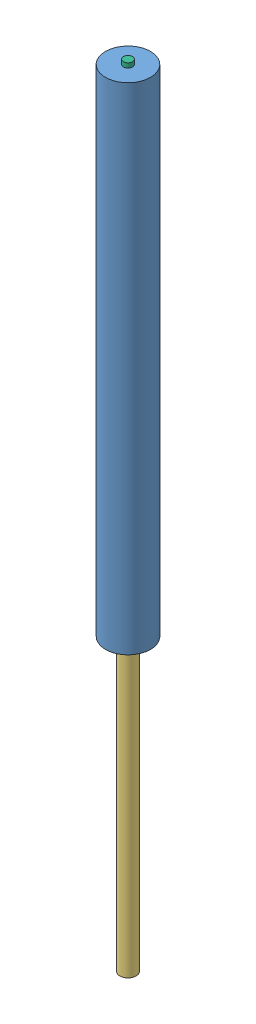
SolidWorks assembly Gas Lift System.SLDASM, configuration Default (file format 15000). Lengths in mm.
Overall size (54.46 876.94 54.46).
6 component instances, 6 part files, 12 mates.
Components (placement in the parent):
- Outer cylinder-1: Outer cylinder.SLDPRT [Default] at (213.86 144.9503 398.3266) size (50 550 50)
- Piston Guiding Cylinder-1: Piston Guiding Cylinder.SLDPRT [Default] at (154.1952 470.4424 393.582) x (0.96832 0 0.249713) z (-0.249713 0 0.96832) size (38 500 38)
- Piston-1: Piston.SLDPRT [Default] at (176.7643 58.5024 411.6908) x (-0.29793 0 -0.954588) z (0.954588 0 -0.29793) size (28 430 28)
- Retainer-1: Retainer.SLDPRT [Default] at (172.5932 -29.5576 398.3266) x (-0.872082 0 0.489359) z (-0.489359 0 -0.872082) size (40 15 40)
- Upper Retainer-1: Upper Retainer.SLDPRT [Default] at (167.5948 495.4424 398.1999) x (0.999679 0 0.02533) z (-0.02533 0 0.999679) size (40 40 40)
- Valve-1: Valve.SLDPRT [Default] at (172.5932 505.4424 398.3266) x (0.221821 0 -0.975087) z (0.975087 0 0.221821) size (14 50 14)
Mates (geometry in assembly coordinates):
- Concentric1: concentric aligned: cylinder of Piston-1 through (172.5932 58.5024 398.3266) axis (0 1 0) radius 9; cylinder of Outer cylinder-1 through (172.5932 445.4424 398.3266) axis (0 1 0) radius 10
- Concentric2: concentric aligned: cylinder of Outer cylinder-1 through (172.5932 445.4424 398.3266) axis (0 1 0) radius 25; cylinder of Piston Guiding Cylinder-1 through (172.5932 470.4424 398.3266) axis (0 1 0) radius 14
- Coincident1: coincident aligned: circle of Upper Retainer-1; cylinder of Valve-1 through (172.5932 505.4424 398.3266) axis (0 1 0) radius 5
- Concentric3: concentric aligned: cylinder of Piston Guiding Cylinder-1 through (172.5932 470.4424 398.3266) axis (0 1 0) radius 14; cylinder of Piston-1 through (172.5932 58.5024 398.3266) axis (0 1 0) radius 14
- Concentric4: concentric aligned: cylinder of Outer cylinder-1 through (172.5932 445.4424 398.3266) axis (0 1 0) radius 20; cylinder of Piston Guiding Cylinder-1 through (172.5932 470.4424 398.3266) axis (0 1 0) radius 19
- LimitDistance1: limit distance aligned: cone of Upper Retainer-1 through (172.5932 455.4424 398.3266) axis (0 1 0); cone of Valve-1 through (172.5932 457.4424 398.3266) axis (0 1 0)
- Concentric5: concentric aligned: cylinder of Outer cylinder-1 through (172.5932 445.4424 398.3266) axis (0 1 0) radius 20; cylinder of Upper Retainer-1 through (172.5932 498.401 398.3266) axis (0 1 0) radius 20
- Coincident3: coincident anti-aligned: plane of Piston Guiding Cylinder-1 through (159.0368 470.4424 394.8306) normal (0 1 0); plane of Upper Retainer-1 through (153.5993 470.4424 397.8453) normal (0 -1 0)
- Coincident4: coincident anti-aligned: plane of Outer cylinder-1 through (167.5948 495.4424 398.3266) normal (0 -1 0); plane of Upper Retainer-1 through (167.5948 495.4424 398.1999) normal (0 1 0)
- LimitDistance2: limit distance = 396.94 mm anti-aligned: plane of Piston-1 through (176.7643 58.5024 411.6908) normal (0 1 0); plane of Upper Retainer-1 through (158.5977 455.4424 397.9719) normal (0 -1 0)
- Concentric7: concentric aligned: cylinder of Piston-1 through (172.5932 58.5024 398.3266) axis (0 1 0) radius 9; cylinder of Retainer-1 through (172.5932 -29.5576 398.3266) axis (0 1 0) radius 10
- Coincident8: coincident anti-aligned: circle of Outer cylinder-1; plane of Retainer-1 through (172.5932 -44.5576 398.3266) normal (0 -1 0)
